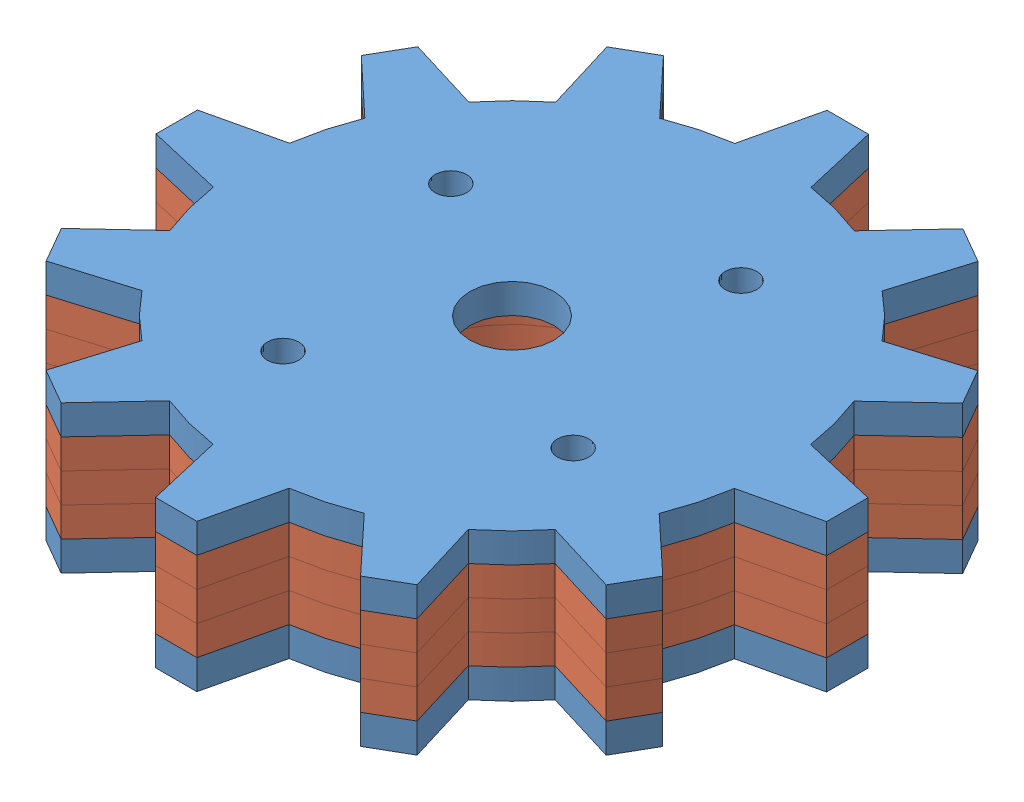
SolidWorks assembly Assem2.SLDASM, configuration Default (file format 12000). Lengths in mm.
Overall size (87 14 87).
6 component instances, 3 part files, 14 mates.
Components (placement in the parent):
- 3_buzo-1: 3_buzo.SLDPRT [Default] at (35.3174 62.2938 30.0837) x (0.50068 0 -0.865632) z (0.865632 0 0.50068) size (63.67 2.8 63.67)
- 1_buzo-2: 1_buzo.SLDPRT [Default] at (35.3174 65.0938 30.0837) x (0.50068 0 -0.865632) z (0.865632 0 0.50068) size (63.67 2.8 63.67)
- Part1-1: Part1.SLDPRT [Default] at (35.3174 65.0938 30.0837) (suppressed, hidden)
- 1_buzo-3: 1_buzo.SLDPRT [Default] at (35.3174 70.6938 30.0837) x (-0.50068 0 0.865632) z (0.865632 0 0.50068) size (63.67 2.8 63.67)
- 1_buzo-4: 1_buzo.SLDPRT [Default] at (35.3174 70.6938 30.0837) x (-0.50068 0 0.865632) z (-0.865632 0 -0.50068) size (63.67 2.8 63.67)
- 3_buzo-2: 3_buzo.SLDPRT [Default] at (35.3174 73.4938 30.0837) x (0.50068 0 -0.865632) z (0.865632 0 0.50068) size (63.67 2.8 63.67)
Mates (geometry in assembly coordinates):
- Concentric1: concentric anti-aligned: cylinder of 1_buzo-2 through (35.3174 57.8938 30.0837) axis (0 1 0) radius 10.9; cylinder of Part1-1 through (35.3174 72.0938 30.0837) axis (0 -1 0) radius 10.9
- Coincident1: coincident aligned: circle of 1_buzo-2; circle of Part1-1
- Concentric2: concentric aligned: cylinder of Part1-1 through (35.3174 72.0938 30.0837) axis (0 -1 0) radius 10.9; cylinder of 1_buzo-3 through (35.3174 77.8938 30.0837) axis (0 -1 0) radius 10.9
- Concentric3: concentric anti-aligned: cylinder of 1_buzo-2 through (49.081 57.8938 38.0446) axis (0 1 0) radius 1.5; cylinder of 1_buzo-3 through (49.081 77.8938 38.0446) axis (0 -1 0) radius 1.5
- Coincident5: coincident anti-aligned: plane of 1_buzo-2 through (35.3174 67.8938 30.0837) normal (0 1 0); plane of 1_buzo-3 through (35.3174 67.8938 30.0837) normal (0 -1 0)
- Concentric4: concentric anti-aligned: cylinder of Part1-1 through (35.3174 72.0938 30.0837) axis (0 -1 0) radius 10.9; cylinder of 1_buzo-4 through (35.3174 63.4938 30.0837) axis (0 1 0) radius 10.9
- Concentric5: concentric anti-aligned: cylinder of 1_buzo-3 through (21.5539 77.8938 22.1229) axis (0 -1 0) radius 1.5; cylinder of 1_buzo-4 through (21.5539 63.4938 22.1229) axis (0 1 0) radius 1.5
- Coincident7: coincident anti-aligned: plane of 1_buzo-3 through (35.3174 70.6938 30.0837) normal (0 1 0); plane of 1_buzo-4 through (35.3174 70.6938 30.0837) normal (0 -1 0)
- Concentric6: concentric anti-aligned: cylinder of 3_buzo-1 through (35.3174 55.0938 30.0837) axis (0 1 0) radius 4; cylinder of Part1-1 through (35.3174 72.0938 30.0837) axis (0 -1 0) radius 4
- Coincident8: coincident anti-aligned: plane of 3_buzo-1 through (35.3174 65.0938 30.0837) normal (0 1 0); plane of 1_buzo-2 through (35.3174 65.0938 30.0837) normal (0 -1 0)
- Concentric7: concentric aligned: cylinder of 3_buzo-1 through (27.3566 55.0938 43.8473) axis (0 1 0) radius 1.5; cylinder of 1_buzo-2 through (27.3566 57.8938 43.8473) axis (0 1 0) radius 1.5
- Concentric8: concentric anti-aligned: cylinder of Part1-1 through (35.3174 72.0938 30.0837) axis (0 -1 0) radius 4; cylinder of 3_buzo-2 through (35.3174 66.2938 30.0837) axis (0 1 0) radius 4
- Coincident9: coincident anti-aligned: plane of 1_buzo-4 through (35.3174 73.4938 30.0837) normal (0 1 0); plane of 3_buzo-2 through (35.3174 73.4938 30.0837) normal (0 -1 0)
- Concentric9: concentric aligned: cylinder of 1_buzo-4 through (49.081 63.4938 38.0446) axis (0 1 0) radius 1.5; cylinder of 3_buzo-2 through (49.081 66.2938 38.0446) axis (0 1 0) radius 1.5
